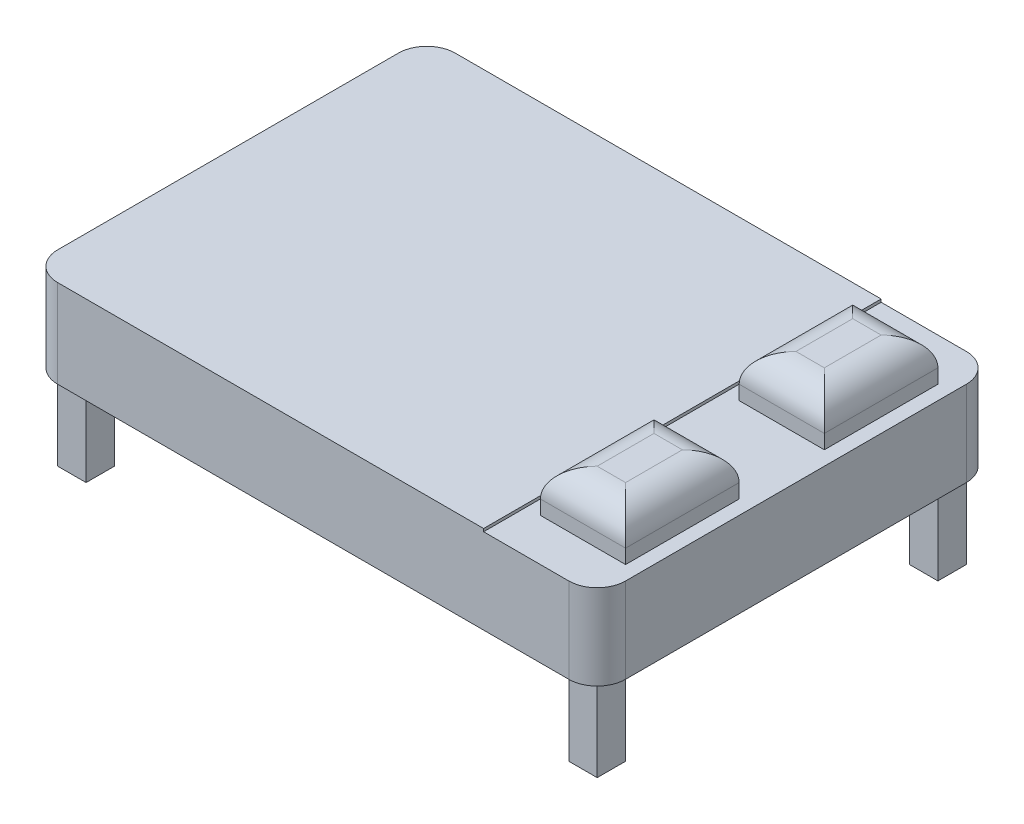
ISO-10303-21;
HEADER;
FILE_DESCRIPTION(('STEP AP214'),'2;1');
FILE_NAME('part.step','',(''),(''),'','','');
FILE_SCHEMA(('AUTOMOTIVE_DESIGN { 1 0 10303 214 1 1 1 1 }'));
ENDSEC;
DATA;
#1=APPLICATION_CONTEXT('core data for automotive mechanical design processes');
#2=APPLICATION_PROTOCOL_DEFINITION('international standard','automotive_design',2000,#1);
#3=PRODUCT_CONTEXT('',#1,'mechanical');
#4=PRODUCT('Part','Part','',(#3));
#5=PRODUCT_RELATED_PRODUCT_CATEGORY('part','',(#4));
#6=PRODUCT_DEFINITION_FORMATION('','',#4);
#7=PRODUCT_DEFINITION_CONTEXT('part definition',#1,'design');
#8=PRODUCT_DEFINITION('design','',#6,#7);
#9=PRODUCT_DEFINITION_SHAPE('','',#8);
#10=(LENGTH_UNIT() NAMED_UNIT(*) SI_UNIT(.MILLI.,.METRE.));
#11=(NAMED_UNIT(*) PLANE_ANGLE_UNIT() SI_UNIT($,.RADIAN.));
#12=(NAMED_UNIT(*) SI_UNIT($,.STERADIAN.) SOLID_ANGLE_UNIT());
#13=UNCERTAINTY_MEASURE_WITH_UNIT(LENGTH_MEASURE(1.E-05),#10,'distance_accuracy_value','');
#14=(GEOMETRIC_REPRESENTATION_CONTEXT(3) GLOBAL_UNCERTAINTY_ASSIGNED_CONTEXT((#13)) GLOBAL_UNIT_ASSIGNED_CONTEXT((#10,
#11,#12)) REPRESENTATION_CONTEXT('',''));
#15=CARTESIAN_POINT('',(0.,0.,0.));
#16=DIRECTION('',(0.,0.,1.));
#17=DIRECTION('',(1.,0.,0.));
#18=AXIS2_PLACEMENT_3D('',#15,#16,#17);
#19=CARTESIAN_POINT('',(0.,300.,0.));
#20=DIRECTION('',(0.,1.,0.));
#21=DIRECTION('',(0.,0.,1.));
#22=AXIS2_PLACEMENT_3D('',#19,#20,#21);
#23=PLANE('',#22);
#24=DIRECTION('',(0.,0.,-1.));
#25=VECTOR('',#24,1.);
#26=CARTESIAN_POINT('',(1000.,300.,700.));
#27=LINE('',#26,#25);
#28=CARTESIAN_POINT('',(1000.,300.,600.));
#29=VERTEX_POINT('',#28);
#30=CARTESIAN_POINT('',(1000.,300.,-600.));
#31=VERTEX_POINT('',#30);
#32=EDGE_CURVE('E424',#29,#31,#27,.T.);
#33=ORIENTED_EDGE('',*,*,#32,.T.);
#34=CARTESIAN_POINT('',(900.,300.,-600.));
#35=DIRECTION('',(0.,1.,0.));
#36=DIRECTION('',(0.,0.,1.));
#37=AXIS2_PLACEMENT_3D('',#34,#35,#36);
#38=CIRCLE('',#37,100.);
#39=CARTESIAN_POINT('',(900.,300.,-700.));
#40=VERTEX_POINT('',#39);
#41=EDGE_CURVE('E451',#31,#40,#38,.T.);
#42=ORIENTED_EDGE('',*,*,#41,.T.);
#43=DIRECTION('',(-1.,0.,0.));
#44=VECTOR('',#43,1.);
#45=CARTESIAN_POINT('',(1000.,300.,-700.));
#46=LINE('',#45,#44);
#47=CARTESIAN_POINT('',(600.,300.,-700.));
#48=VERTEX_POINT('',#47);
#49=EDGE_CURVE('E369',#40,#48,#46,.T.);
#50=ORIENTED_EDGE('',*,*,#49,.T.);
#51=DIRECTION('',(0.,0.,-1.));
#52=VECTOR('',#51,1.);
#53=CARTESIAN_POINT('',(600.,300.,-700.));
#54=LINE('',#53,#52);
#55=CARTESIAN_POINT('',(600.,300.,700.));
#56=VERTEX_POINT('',#55);
#57=EDGE_CURVE('E334',#56,#48,#54,.T.);
#58=ORIENTED_EDGE('',*,*,#57,.F.);
#59=DIRECTION('',(1.,0.,0.));
#60=VECTOR('',#59,1.);
#61=CARTESIAN_POINT('',(1000.,300.,700.));
#62=LINE('',#61,#60);
#63=CARTESIAN_POINT('',(900.,300.,700.));
#64=VERTEX_POINT('',#63);
#65=EDGE_CURVE('E353',#56,#64,#62,.T.);
#66=ORIENTED_EDGE('',*,*,#65,.T.);
#67=CARTESIAN_POINT('',(900.,300.,600.));
#68=DIRECTION('',(0.,1.,0.));
#69=DIRECTION('',(0.,0.,1.));
#70=AXIS2_PLACEMENT_3D('',#67,#68,#69);
#71=CIRCLE('',#70,100.);
#72=EDGE_CURVE('E453',#64,#29,#71,.T.);
#73=ORIENTED_EDGE('',*,*,#72,.T.);
#74=EDGE_LOOP('',(#33,#42,#50,#58,#66,#73));
#75=FACE_BOUND('',#74,.T.);
#76=DIRECTION('',(1.,0.,0.));
#77=VECTOR('',#76,1.);
#78=CARTESIAN_POINT('',(650.,300.,-150.));
#79=LINE('',#78,#77);
#80=CARTESIAN_POINT('',(650.,300.,-150.));
#81=VERTEX_POINT('',#80);
#82=CARTESIAN_POINT('',(950.,300.,-150.));
#83=VERTEX_POINT('',#82);
#84=EDGE_CURVE('E317',#81,#83,#79,.T.);
#85=ORIENTED_EDGE('',*,*,#84,.F.);
#86=DIRECTION('',(0.,0.,1.));
#87=VECTOR('',#86,1.);
#88=CARTESIAN_POINT('',(650.,300.,-550.));
#89=LINE('',#88,#87);
#90=CARTESIAN_POINT('',(650.,300.,-550.));
#91=VERTEX_POINT('',#90);
#92=EDGE_CURVE('E291',#91,#81,#89,.T.);
#93=ORIENTED_EDGE('',*,*,#92,.F.);
#94=DIRECTION('',(-1.,0.,0.));
#95=VECTOR('',#94,1.);
#96=CARTESIAN_POINT('',(650.,300.,-550.));
#97=LINE('',#96,#95);
#98=CARTESIAN_POINT('',(950.,300.,-550.));
#99=VERTEX_POINT('',#98);
#100=EDGE_CURVE('E323',#99,#91,#97,.T.);
#101=ORIENTED_EDGE('',*,*,#100,.F.);
#102=DIRECTION('',(0.,0.,-1.));
#103=VECTOR('',#102,1.);
#104=CARTESIAN_POINT('',(950.,300.,-550.));
#105=LINE('',#104,#103);
#106=EDGE_CURVE('E320',#83,#99,#105,.T.);
#107=ORIENTED_EDGE('',*,*,#106,.F.);
#108=EDGE_LOOP('',(#85,#93,#101,#107));
#109=FACE_BOUND('',#108,.T.);
#110=DIRECTION('',(1.,0.,0.));
#111=VECTOR('',#110,1.);
#112=CARTESIAN_POINT('',(650.,300.,550.));
#113=LINE('',#112,#111);
#114=CARTESIAN_POINT('',(650.,300.,550.));
#115=VERTEX_POINT('',#114);
#116=CARTESIAN_POINT('',(950.,300.,550.));
#117=VERTEX_POINT('',#116);
#118=EDGE_CURVE('E285',#115,#117,#113,.T.);
#119=ORIENTED_EDGE('',*,*,#118,.F.);
#120=DIRECTION('',(0.,0.,1.));
#121=VECTOR('',#120,1.);
#122=CARTESIAN_POINT('',(650.,300.,150.));
#123=LINE('',#122,#121);
#124=CARTESIAN_POINT('',(650.,300.,150.));
#125=VERTEX_POINT('',#124);
#126=EDGE_CURVE('E295',#125,#115,#123,.T.);
#127=ORIENTED_EDGE('',*,*,#126,.F.);
#128=DIRECTION('',(-1.,0.,0.));
#129=VECTOR('',#128,1.);
#130=CARTESIAN_POINT('',(650.,300.,150.));
#131=LINE('',#130,#129);
#132=CARTESIAN_POINT('',(950.,300.,150.));
#133=VERTEX_POINT('',#132);
#134=EDGE_CURVE('E307',#133,#125,#131,.T.);
#135=ORIENTED_EDGE('',*,*,#134,.F.);
#136=DIRECTION('',(0.,0.,-1.));
#137=VECTOR('',#136,1.);
#138=CARTESIAN_POINT('',(950.,300.,150.));
#139=LINE('',#138,#137);
#140=EDGE_CURVE('E305',#117,#133,#139,.T.);
#141=ORIENTED_EDGE('',*,*,#140,.F.);
#142=EDGE_LOOP('',(#119,#127,#135,#141));
#143=FACE_BOUND('',#142,.T.);
#144=ADVANCED_FACE('F34',(#75,#109,#143),#23,.T.);
#145=CARTESIAN_POINT('',(0.,0.,0.));
#146=DIRECTION('',(0.,1.,0.));
#147=DIRECTION('',(0.,0.,1.));
#148=AXIS2_PLACEMENT_3D('',#145,#146,#147);
#149=PLANE('',#148);
#150=DIRECTION('',(0.,0.,1.));
#151=VECTOR('',#150,1.);
#152=CARTESIAN_POINT('',(-850.,0.,650.));
#153=LINE('',#152,#151);
#154=CARTESIAN_POINT('',(-850.,0.,550.));
#155=VERTEX_POINT('',#154);
#156=CARTESIAN_POINT('',(-850.,0.,650.));
#157=VERTEX_POINT('',#156);
#158=EDGE_CURVE('E1111',#155,#157,#153,.T.);
#159=ORIENTED_EDGE('',*,*,#158,.F.);
#160=DIRECTION('',(1.,0.,0.));
#161=VECTOR('',#160,1.);
#162=CARTESIAN_POINT('',(-950.,0.,550.));
#163=LINE('',#162,#161);
#164=CARTESIAN_POINT('',(-950.,0.,550.));
#165=VERTEX_POINT('',#164);
#166=EDGE_CURVE('E1116',#165,#155,#163,.T.);
#167=ORIENTED_EDGE('',*,*,#166,.F.);
#168=DIRECTION('',(0.,0.,-1.));
#169=VECTOR('',#168,1.);
#170=CARTESIAN_POINT('',(-950.,0.,650.));
#171=LINE('',#170,#169);
#172=CARTESIAN_POINT('',(-950.,0.,650.));
#173=VERTEX_POINT('',#172);
#174=EDGE_CURVE('E1128',#173,#165,#171,.T.);
#175=ORIENTED_EDGE('',*,*,#174,.F.);
#176=DIRECTION('',(-1.,0.,0.));
#177=VECTOR('',#176,1.);
#178=CARTESIAN_POINT('',(-950.,0.,650.));
#179=LINE('',#178,#177);
#180=EDGE_CURVE('E1125',#157,#173,#179,.T.);
#181=ORIENTED_EDGE('',*,*,#180,.F.);
#182=EDGE_LOOP('',(#159,#167,#175,#181));
#183=FACE_BOUND('',#182,.T.);
#184=DIRECTION('',(-1.,0.,0.));
#185=VECTOR('',#184,1.);
#186=CARTESIAN_POINT('',(1000.,0.,-700.));
#187=LINE('',#186,#185);
#188=CARTESIAN_POINT('',(900.,0.,-700.));
#189=VERTEX_POINT('',#188);
#190=CARTESIAN_POINT('',(-900.,0.,-700.));
#191=VERTEX_POINT('',#190);
#192=EDGE_CURVE('E437',#189,#191,#187,.T.);
#193=ORIENTED_EDGE('',*,*,#192,.F.);
#194=CARTESIAN_POINT('',(900.,0.,-600.));
#195=DIRECTION('',(0.,1.,0.));
#196=DIRECTION('',(0.,0.,1.));
#197=AXIS2_PLACEMENT_3D('',#194,#195,#196);
#198=CIRCLE('',#197,100.);
#199=CARTESIAN_POINT('',(1000.,0.,-600.));
#200=VERTEX_POINT('',#199);
#201=EDGE_CURVE('E491',#189,#200,#198,.F.);
#202=ORIENTED_EDGE('',*,*,#201,.T.);
#203=DIRECTION('',(0.,0.,-1.));
#204=VECTOR('',#203,1.);
#205=CARTESIAN_POINT('',(1000.,0.,700.));
#206=LINE('',#205,#204);
#207=CARTESIAN_POINT('',(1000.,0.,600.));
#208=VERTEX_POINT('',#207);
#209=EDGE_CURVE('E435',#208,#200,#206,.T.);
#210=ORIENTED_EDGE('',*,*,#209,.F.);
#211=CARTESIAN_POINT('',(900.,0.,600.));
#212=DIRECTION('',(0.,1.,0.));
#213=DIRECTION('',(0.,0.,1.));
#214=AXIS2_PLACEMENT_3D('',#211,#212,#213);
#215=CIRCLE('',#214,100.);
#216=CARTESIAN_POINT('',(900.,0.,700.));
#217=VERTEX_POINT('',#216);
#218=EDGE_CURVE('E487',#208,#217,#215,.F.);
#219=ORIENTED_EDGE('',*,*,#218,.T.);
#220=DIRECTION('',(1.,0.,0.));
#221=VECTOR('',#220,1.);
#222=CARTESIAN_POINT('',(1000.,0.,700.));
#223=LINE('',#222,#221);
#224=CARTESIAN_POINT('',(-900.,0.,700.));
#225=VERTEX_POINT('',#224);
#226=EDGE_CURVE('E431',#225,#217,#223,.T.);
#227=ORIENTED_EDGE('',*,*,#226,.F.);
#228=CARTESIAN_POINT('',(-900.,0.,600.));
#229=DIRECTION('',(0.,1.,0.));
#230=DIRECTION('',(0.,0.,1.));
#231=AXIS2_PLACEMENT_3D('',#228,#229,#230);
#232=CIRCLE('',#231,100.);
#233=CARTESIAN_POINT('',(-1000.,0.,600.));
#234=VERTEX_POINT('',#233);
#235=EDGE_CURVE('E485',#225,#234,#232,.F.);
#236=ORIENTED_EDGE('',*,*,#235,.T.);
#237=DIRECTION('',(0.,0.,1.));
#238=VECTOR('',#237,1.);
#239=CARTESIAN_POINT('',(-1000.,0.,700.));
#240=LINE('',#239,#238);
#241=CARTESIAN_POINT('',(-1000.,0.,-600.));
#242=VERTEX_POINT('',#241);
#243=EDGE_CURVE('E429',#242,#234,#240,.T.);
#244=ORIENTED_EDGE('',*,*,#243,.F.);
#245=CARTESIAN_POINT('',(-900.,0.,-600.));
#246=DIRECTION('',(0.,1.,0.));
#247=DIRECTION('',(0.,0.,1.));
#248=AXIS2_PLACEMENT_3D('',#245,#246,#247);
#249=CIRCLE('',#248,100.);
#250=EDGE_CURVE('E489',#242,#191,#249,.F.);
#251=ORIENTED_EDGE('',*,*,#250,.T.);
#252=EDGE_LOOP('',(#193,#202,#210,#219,#227,#236,#244,#251));
#253=FACE_BOUND('',#252,.T.);
#254=DIRECTION('',(1.,0.,0.));
#255=VECTOR('',#254,1.);
#256=CARTESIAN_POINT('',(-950.,0.,-550.));
#257=LINE('',#256,#255);
#258=CARTESIAN_POINT('',(-950.,0.,-550.));
#259=VERTEX_POINT('',#258);
#260=CARTESIAN_POINT('',(-850.,0.,-550.));
#261=VERTEX_POINT('',#260);
#262=EDGE_CURVE('E1095',#259,#261,#257,.T.);
#263=ORIENTED_EDGE('',*,*,#262,.T.);
#264=DIRECTION('',(0.,0.,-1.));
#265=VECTOR('',#264,1.);
#266=CARTESIAN_POINT('',(-850.,0.,-650.));
#267=LINE('',#266,#265);
#268=CARTESIAN_POINT('',(-850.,0.,-650.));
#269=VERTEX_POINT('',#268);
#270=EDGE_CURVE('E1078',#261,#269,#267,.T.);
#271=ORIENTED_EDGE('',*,*,#270,.T.);
#272=DIRECTION('',(-1.,0.,0.));
#273=VECTOR('',#272,1.);
#274=CARTESIAN_POINT('',(-950.,0.,-650.));
#275=LINE('',#274,#273);
#276=CARTESIAN_POINT('',(-950.,0.,-650.));
#277=VERTEX_POINT('',#276);
#278=EDGE_CURVE('E1083',#269,#277,#275,.T.);
#279=ORIENTED_EDGE('',*,*,#278,.T.);
#280=DIRECTION('',(0.,0.,1.));
#281=VECTOR('',#280,1.);
#282=CARTESIAN_POINT('',(-950.,0.,-650.));
#283=LINE('',#282,#281);
#284=EDGE_CURVE('E1098',#277,#259,#283,.T.);
#285=ORIENTED_EDGE('',*,*,#284,.T.);
#286=EDGE_LOOP('',(#263,#271,#279,#285));
#287=FACE_BOUND('',#286,.T.);
#288=DIRECTION('',(-1.,0.,0.));
#289=VECTOR('',#288,1.);
#290=CARTESIAN_POINT('',(950.,0.,550.));
#291=LINE('',#290,#289);
#292=CARTESIAN_POINT('',(950.,0.,550.));
#293=VERTEX_POINT('',#292);
#294=CARTESIAN_POINT('',(850.,0.,550.));
#295=VERTEX_POINT('',#294);
#296=EDGE_CURVE('E1042',#293,#295,#291,.T.);
#297=ORIENTED_EDGE('',*,*,#296,.T.);
#298=DIRECTION('',(0.,0.,1.));
#299=VECTOR('',#298,1.);
#300=CARTESIAN_POINT('',(850.,0.,650.));
#301=LINE('',#300,#299);
#302=CARTESIAN_POINT('',(850.,0.,650.));
#303=VERTEX_POINT('',#302);
#304=EDGE_CURVE('E1038',#295,#303,#301,.T.);
#305=ORIENTED_EDGE('',*,*,#304,.T.);
#306=DIRECTION('',(1.,0.,0.));
#307=VECTOR('',#306,1.);
#308=CARTESIAN_POINT('',(950.,0.,650.));
#309=LINE('',#308,#307);
#310=CARTESIAN_POINT('',(950.,0.,650.));
#311=VERTEX_POINT('',#310);
#312=EDGE_CURVE('E1053',#303,#311,#309,.T.);
#313=ORIENTED_EDGE('',*,*,#312,.T.);
#314=DIRECTION('',(0.,0.,-1.));
#315=VECTOR('',#314,1.);
#316=CARTESIAN_POINT('',(950.,0.,650.));
#317=LINE('',#316,#315);
#318=EDGE_CURVE('E1065',#311,#293,#317,.T.);
#319=ORIENTED_EDGE('',*,*,#318,.T.);
#320=EDGE_LOOP('',(#297,#305,#313,#319));
#321=FACE_BOUND('',#320,.T.);
#322=DIRECTION('',(0.,0.,-1.));
#323=VECTOR('',#322,1.);
#324=CARTESIAN_POINT('',(850.,0.,-650.));
#325=LINE('',#324,#323);
#326=CARTESIAN_POINT('',(850.,0.,-550.));
#327=VERTEX_POINT('',#326);
#328=CARTESIAN_POINT('',(850.,0.,-650.));
#329=VERTEX_POINT('',#328);
#330=EDGE_CURVE('E363',#327,#329,#325,.T.);
#331=ORIENTED_EDGE('',*,*,#330,.F.);
#332=DIRECTION('',(-1.,0.,0.));
#333=VECTOR('',#332,1.);
#334=CARTESIAN_POINT('',(950.,0.,-550.));
#335=LINE('',#334,#333);
#336=CARTESIAN_POINT('',(950.,0.,-550.));
#337=VERTEX_POINT('',#336);
#338=EDGE_CURVE('E1033',#337,#327,#335,.T.);
#339=ORIENTED_EDGE('',*,*,#338,.F.);
#340=DIRECTION('',(0.,0.,1.));
#341=VECTOR('',#340,1.);
#342=CARTESIAN_POINT('',(950.,0.,-650.));
#343=LINE('',#342,#341);
#344=CARTESIAN_POINT('',(950.,0.,-650.));
#345=VERTEX_POINT('',#344);
#346=EDGE_CURVE('E1167',#345,#337,#343,.T.);
#347=ORIENTED_EDGE('',*,*,#346,.F.);
#348=DIRECTION('',(1.,0.,0.));
#349=VECTOR('',#348,1.);
#350=CARTESIAN_POINT('',(950.,0.,-650.));
#351=LINE('',#350,#349);
#352=EDGE_CURVE('E1162',#329,#345,#351,.T.);
#353=ORIENTED_EDGE('',*,*,#352,.F.);
#354=EDGE_LOOP('',(#331,#339,#347,#353));
#355=FACE_BOUND('',#354,.T.);
#356=ADVANCED_FACE('F482',(#183,#253,#287,#321,#355),#149,.F.);
#357=CARTESIAN_POINT('',(-1000.,300.,700.));
#358=DIRECTION('',(1.,0.,0.));
#359=DIRECTION('',(0.,0.,-1.));
#360=AXIS2_PLACEMENT_3D('',#357,#358,#359);
#361=PLANE('',#360);
#362=DIRECTION('',(0.,0.,1.));
#363=VECTOR('',#362,1.);
#364=CARTESIAN_POINT('',(-1000.,310.,-700.));
#365=LINE('',#364,#363);
#366=CARTESIAN_POINT('',(-1000.,310.,-600.));
#367=VERTEX_POINT('',#366);
#368=CARTESIAN_POINT('',(-1000.,310.,600.));
#369=VERTEX_POINT('',#368);
#370=EDGE_CURVE('E335',#367,#369,#365,.T.);
#371=ORIENTED_EDGE('',*,*,#370,.F.);
#372=DIRECTION('',(0.,-1.,0.));
#373=VECTOR('',#372,1.);
#374=CARTESIAN_POINT('',(-1000.,300.,-600.));
#375=LINE('',#374,#373);
#376=EDGE_CURVE('E464',#367,#242,#375,.T.);
#377=ORIENTED_EDGE('',*,*,#376,.T.);
#378=ORIENTED_EDGE('',*,*,#243,.T.);
#379=DIRECTION('',(0.,-1.,0.));
#380=VECTOR('',#379,1.);
#381=CARTESIAN_POINT('',(-1000.,300.,600.));
#382=LINE('',#381,#380);
#383=EDGE_CURVE('E57',#234,#369,#382,.F.);
#384=ORIENTED_EDGE('',*,*,#383,.T.);
#385=EDGE_LOOP('',(#371,#377,#378,#384));
#386=FACE_BOUND('',#385,.T.);
#387=ADVANCED_FACE('F509',(#386),#361,.F.);
#388=CARTESIAN_POINT('',(1000.,300.,700.));
#389=DIRECTION('',(0.,0.,-1.));
#390=DIRECTION('',(-1.,0.,0.));
#391=AXIS2_PLACEMENT_3D('',#388,#389,#390);
#392=PLANE('',#391);
#393=ORIENTED_EDGE('',*,*,#226,.T.);
#394=DIRECTION('',(0.,-1.,0.));
#395=VECTOR('',#394,1.);
#396=CARTESIAN_POINT('',(900.,300.,700.));
#397=LINE('',#396,#395);
#398=EDGE_CURVE('E11',#217,#64,#397,.F.);
#399=ORIENTED_EDGE('',*,*,#398,.T.);
#400=ORIENTED_EDGE('',*,*,#65,.F.);
#401=DIRECTION('',(0.,-1.,0.));
#402=VECTOR('',#401,1.);
#403=CARTESIAN_POINT('',(600.,310.,700.));
#404=LINE('',#403,#402);
#405=CARTESIAN_POINT('',(600.,310.,700.));
#406=VERTEX_POINT('',#405);
#407=EDGE_CURVE('E358',#406,#56,#404,.T.);
#408=ORIENTED_EDGE('',*,*,#407,.F.);
#409=DIRECTION('',(1.,0.,0.));
#410=VECTOR('',#409,1.);
#411=CARTESIAN_POINT('',(-1000.,310.,700.));
#412=LINE('',#411,#410);
#413=CARTESIAN_POINT('',(-900.,310.,700.));
#414=VERTEX_POINT('',#413);
#415=EDGE_CURVE('E337',#414,#406,#412,.T.);
#416=ORIENTED_EDGE('',*,*,#415,.F.);
#417=DIRECTION('',(0.,-1.,0.));
#418=VECTOR('',#417,1.);
#419=CARTESIAN_POINT('',(-900.,300.,700.));
#420=LINE('',#419,#418);
#421=EDGE_CURVE('E42',#414,#225,#420,.T.);
#422=ORIENTED_EDGE('',*,*,#421,.T.);
#423=EDGE_LOOP('',(#393,#399,#400,#408,#416,#422));
#424=FACE_BOUND('',#423,.T.);
#425=ADVANCED_FACE('F477',(#424),#392,.F.);
#426=CARTESIAN_POINT('',(1000.,300.,700.));
#427=DIRECTION('',(-1.,0.,0.));
#428=DIRECTION('',(0.,0.,1.));
#429=AXIS2_PLACEMENT_3D('',#426,#427,#428);
#430=PLANE('',#429);
#431=ORIENTED_EDGE('',*,*,#209,.T.);
#432=DIRECTION('',(0.,-1.,0.));
#433=VECTOR('',#432,1.);
#434=CARTESIAN_POINT('',(1000.,300.,-600.));
#435=LINE('',#434,#433);
#436=EDGE_CURVE('E461',#200,#31,#435,.F.);
#437=ORIENTED_EDGE('',*,*,#436,.T.);
#438=ORIENTED_EDGE('',*,*,#32,.F.);
#439=DIRECTION('',(0.,-1.,0.));
#440=VECTOR('',#439,1.);
#441=CARTESIAN_POINT('',(1000.,300.,600.));
#442=LINE('',#441,#440);
#443=EDGE_CURVE('E496',#29,#208,#442,.T.);
#444=ORIENTED_EDGE('',*,*,#443,.T.);
#445=EDGE_LOOP('',(#431,#437,#438,#444));
#446=FACE_BOUND('',#445,.T.);
#447=ADVANCED_FACE('F497',(#446),#430,.F.);
#448=CARTESIAN_POINT('',(1000.,300.,-700.));
#449=DIRECTION('',(0.,0.,1.));
#450=DIRECTION('',(1.,0.,0.));
#451=AXIS2_PLACEMENT_3D('',#448,#449,#450);
#452=PLANE('',#451);
#453=ORIENTED_EDGE('',*,*,#49,.F.);
#454=DIRECTION('',(0.,-1.,0.));
#455=VECTOR('',#454,1.);
#456=CARTESIAN_POINT('',(900.,300.,-700.));
#457=LINE('',#456,#455);
#458=EDGE_CURVE('E462',#40,#189,#457,.T.);
#459=ORIENTED_EDGE('',*,*,#458,.T.);
#460=ORIENTED_EDGE('',*,*,#192,.T.);
#461=DIRECTION('',(0.,-1.,0.));
#462=VECTOR('',#461,1.);
#463=CARTESIAN_POINT('',(-900.,300.,-700.));
#464=LINE('',#463,#462);
#465=CARTESIAN_POINT('',(-900.,310.,-700.));
#466=VERTEX_POINT('',#465);
#467=EDGE_CURVE('E402',#191,#466,#464,.F.);
#468=ORIENTED_EDGE('',*,*,#467,.T.);
#469=DIRECTION('',(-1.,0.,0.));
#470=VECTOR('',#469,1.);
#471=CARTESIAN_POINT('',(-1000.,310.,-700.));
#472=LINE('',#471,#470);
#473=CARTESIAN_POINT('',(600.,310.,-700.));
#474=VERTEX_POINT('',#473);
#475=EDGE_CURVE('E341',#474,#466,#472,.T.);
#476=ORIENTED_EDGE('',*,*,#475,.F.);
#477=DIRECTION('',(0.,-1.,0.));
#478=VECTOR('',#477,1.);
#479=CARTESIAN_POINT('',(600.,310.,-700.));
#480=LINE('',#479,#478);
#481=EDGE_CURVE('E344',#474,#48,#480,.T.);
#482=ORIENTED_EDGE('',*,*,#481,.T.);
#483=EDGE_LOOP('',(#453,#459,#460,#468,#476,#482));
#484=FACE_BOUND('',#483,.T.);
#485=ADVANCED_FACE('F510',(#484),#452,.F.);
#486=CARTESIAN_POINT('',(-850.,-300.,650.));
#487=DIRECTION('',(-1.,0.,0.));
#488=DIRECTION('',(0.,0.,1.));
#489=AXIS2_PLACEMENT_3D('',#486,#487,#488);
#490=PLANE('',#489);
#491=ORIENTED_EDGE('',*,*,#158,.T.);
#492=DIRECTION('',(0.,1.,0.));
#493=VECTOR('',#492,1.);
#494=CARTESIAN_POINT('',(-850.,-300.,650.));
#495=LINE('',#494,#493);
#496=CARTESIAN_POINT('',(-850.,-300.,650.));
#497=VERTEX_POINT('',#496);
#498=EDGE_CURVE('E432',#497,#157,#495,.T.);
#499=ORIENTED_EDGE('',*,*,#498,.F.);
#500=DIRECTION('',(0.,0.,1.));
#501=VECTOR('',#500,1.);
#502=CARTESIAN_POINT('',(-850.,-300.,650.));
#503=LINE('',#502,#501);
#504=CARTESIAN_POINT('',(-850.,-300.,550.));
#505=VERTEX_POINT('',#504);
#506=EDGE_CURVE('E1112',#505,#497,#503,.T.);
#507=ORIENTED_EDGE('',*,*,#506,.F.);
#508=DIRECTION('',(0.,1.,0.));
#509=VECTOR('',#508,1.);
#510=CARTESIAN_POINT('',(-850.,-300.,550.));
#511=LINE('',#510,#509);
#512=EDGE_CURVE('E1122',#505,#155,#511,.T.);
#513=ORIENTED_EDGE('',*,*,#512,.T.);
#514=EDGE_LOOP('',(#491,#499,#507,#513));
#515=FACE_BOUND('',#514,.T.);
#516=ADVANCED_FACE('F512',(#515),#490,.F.);
#517=CARTESIAN_POINT('',(-950.,-300.,650.));
#518=DIRECTION('',(0.,0.,-1.));
#519=DIRECTION('',(-1.,0.,0.));
#520=AXIS2_PLACEMENT_3D('',#517,#518,#519);
#521=PLANE('',#520);
#522=ORIENTED_EDGE('',*,*,#180,.T.);
#523=DIRECTION('',(0.,1.,0.));
#524=VECTOR('',#523,1.);
#525=CARTESIAN_POINT('',(-950.,-300.,650.));
#526=LINE('',#525,#524);
#527=CARTESIAN_POINT('',(-950.,-300.,650.));
#528=VERTEX_POINT('',#527);
#529=EDGE_CURVE('E1138',#528,#173,#526,.T.);
#530=ORIENTED_EDGE('',*,*,#529,.F.);
#531=DIRECTION('',(-1.,0.,0.));
#532=VECTOR('',#531,1.);
#533=CARTESIAN_POINT('',(-950.,-300.,650.));
#534=LINE('',#533,#532);
#535=EDGE_CURVE('E1115',#497,#528,#534,.T.);
#536=ORIENTED_EDGE('',*,*,#535,.F.);
#537=ORIENTED_EDGE('',*,*,#498,.T.);
#538=EDGE_LOOP('',(#522,#530,#536,#537));
#539=FACE_BOUND('',#538,.T.);
#540=ADVANCED_FACE('F518',(#539),#521,.F.);
#541=CARTESIAN_POINT('',(-950.,-300.,650.));
#542=DIRECTION('',(1.,0.,0.));
#543=DIRECTION('',(0.,0.,-1.));
#544=AXIS2_PLACEMENT_3D('',#541,#542,#543);
#545=PLANE('',#544);
#546=ORIENTED_EDGE('',*,*,#174,.T.);
#547=DIRECTION('',(0.,1.,0.));
#548=VECTOR('',#547,1.);
#549=CARTESIAN_POINT('',(-950.,-300.,550.));
#550=LINE('',#549,#548);
#551=CARTESIAN_POINT('',(-950.,-300.,550.));
#552=VERTEX_POINT('',#551);
#553=EDGE_CURVE('E1135',#552,#165,#550,.T.);
#554=ORIENTED_EDGE('',*,*,#553,.F.);
#555=DIRECTION('',(0.,0.,-1.));
#556=VECTOR('',#555,1.);
#557=CARTESIAN_POINT('',(-950.,-300.,650.));
#558=LINE('',#557,#556);
#559=EDGE_CURVE('E1118',#528,#552,#558,.T.);
#560=ORIENTED_EDGE('',*,*,#559,.F.);
#561=ORIENTED_EDGE('',*,*,#529,.T.);
#562=EDGE_LOOP('',(#546,#554,#560,#561));
#563=FACE_BOUND('',#562,.T.);
#564=ADVANCED_FACE('F532',(#563),#545,.F.);
#565=CARTESIAN_POINT('',(-950.,-300.,550.));
#566=DIRECTION('',(0.,0.,1.));
#567=DIRECTION('',(1.,0.,0.));
#568=AXIS2_PLACEMENT_3D('',#565,#566,#567);
#569=PLANE('',#568);
#570=ORIENTED_EDGE('',*,*,#166,.T.);
#571=ORIENTED_EDGE('',*,*,#512,.F.);
#572=DIRECTION('',(1.,0.,0.));
#573=VECTOR('',#572,1.);
#574=CARTESIAN_POINT('',(-950.,-300.,550.));
#575=LINE('',#574,#573);
#576=EDGE_CURVE('E1120',#552,#505,#575,.T.);
#577=ORIENTED_EDGE('',*,*,#576,.F.);
#578=ORIENTED_EDGE('',*,*,#553,.T.);
#579=EDGE_LOOP('',(#570,#571,#577,#578));
#580=FACE_BOUND('',#579,.T.);
#581=ADVANCED_FACE('F536',(#580),#569,.F.);
#582=CARTESIAN_POINT('',(0.,-300.,0.));
#583=DIRECTION('',(0.,-1.,0.));
#584=DIRECTION('',(0.,0.,-1.));
#585=AXIS2_PLACEMENT_3D('',#582,#583,#584);
#586=PLANE('',#585);
#587=ORIENTED_EDGE('',*,*,#506,.T.);
#588=ORIENTED_EDGE('',*,*,#535,.T.);
#589=ORIENTED_EDGE('',*,*,#559,.T.);
#590=ORIENTED_EDGE('',*,*,#576,.T.);
#591=EDGE_LOOP('',(#587,#588,#589,#590));
#592=FACE_BOUND('',#591,.T.);
#593=ADVANCED_FACE('F540',(#592),#586,.T.);
#594=CARTESIAN_POINT('',(-850.,-300.,-650.));
#595=DIRECTION('',(1.,0.,0.));
#596=DIRECTION('',(0.,0.,-1.));
#597=AXIS2_PLACEMENT_3D('',#594,#595,#596);
#598=PLANE('',#597);
#599=ORIENTED_EDGE('',*,*,#270,.F.);
#600=DIRECTION('',(0.,1.,0.));
#601=VECTOR('',#600,1.);
#602=CARTESIAN_POINT('',(-850.,-300.,-550.));
#603=LINE('',#602,#601);
#604=CARTESIAN_POINT('',(-850.,-300.,-550.));
#605=VERTEX_POINT('',#604);
#606=EDGE_CURVE('E1109',#605,#261,#603,.T.);
#607=ORIENTED_EDGE('',*,*,#606,.F.);
#608=DIRECTION('',(0.,0.,-1.));
#609=VECTOR('',#608,1.);
#610=CARTESIAN_POINT('',(-850.,-300.,-650.));
#611=LINE('',#610,#609);
#612=CARTESIAN_POINT('',(-850.,-300.,-650.));
#613=VERTEX_POINT('',#612);
#614=EDGE_CURVE('E1079',#605,#613,#611,.T.);
#615=ORIENTED_EDGE('',*,*,#614,.T.);
#616=DIRECTION('',(0.,1.,0.));
#617=VECTOR('',#616,1.);
#618=CARTESIAN_POINT('',(-850.,-300.,-650.));
#619=LINE('',#618,#617);
#620=EDGE_CURVE('E1092',#613,#269,#619,.T.);
#621=ORIENTED_EDGE('',*,*,#620,.T.);
#622=EDGE_LOOP('',(#599,#607,#615,#621));
#623=FACE_BOUND('',#622,.T.);
#624=ADVANCED_FACE('F544',(#623),#598,.T.);
#625=CARTESIAN_POINT('',(-950.,-300.,-550.));
#626=DIRECTION('',(0.,0.,1.));
#627=DIRECTION('',(1.,0.,0.));
#628=AXIS2_PLACEMENT_3D('',#625,#626,#627);
#629=PLANE('',#628);
#630=ORIENTED_EDGE('',*,*,#262,.F.);
#631=DIRECTION('',(0.,1.,0.));
#632=VECTOR('',#631,1.);
#633=CARTESIAN_POINT('',(-950.,-300.,-550.));
#634=LINE('',#633,#632);
#635=CARTESIAN_POINT('',(-950.,-300.,-550.));
#636=VERTEX_POINT('',#635);
#637=EDGE_CURVE('E1107',#636,#259,#634,.T.);
#638=ORIENTED_EDGE('',*,*,#637,.F.);
#639=DIRECTION('',(1.,0.,0.));
#640=VECTOR('',#639,1.);
#641=CARTESIAN_POINT('',(-950.,-300.,-550.));
#642=LINE('',#641,#640);
#643=EDGE_CURVE('E1082',#636,#605,#642,.T.);
#644=ORIENTED_EDGE('',*,*,#643,.T.);
#645=ORIENTED_EDGE('',*,*,#606,.T.);
#646=EDGE_LOOP('',(#630,#638,#644,#645));
#647=FACE_BOUND('',#646,.T.);
#648=ADVANCED_FACE('F548',(#647),#629,.T.);
#649=CARTESIAN_POINT('',(-950.,-300.,-650.));
#650=DIRECTION('',(-1.,0.,0.));
#651=DIRECTION('',(0.,0.,1.));
#652=AXIS2_PLACEMENT_3D('',#649,#650,#651);
#653=PLANE('',#652);
#654=ORIENTED_EDGE('',*,*,#284,.F.);
#655=DIRECTION('',(0.,1.,0.));
#656=VECTOR('',#655,1.);
#657=CARTESIAN_POINT('',(-950.,-300.,-650.));
#658=LINE('',#657,#656);
#659=CARTESIAN_POINT('',(-950.,-300.,-650.));
#660=VERTEX_POINT('',#659);
#661=EDGE_CURVE('E1104',#660,#277,#658,.T.);
#662=ORIENTED_EDGE('',*,*,#661,.F.);
#663=DIRECTION('',(0.,0.,1.));
#664=VECTOR('',#663,1.);
#665=CARTESIAN_POINT('',(-950.,-300.,-650.));
#666=LINE('',#665,#664);
#667=EDGE_CURVE('E1086',#660,#636,#666,.T.);
#668=ORIENTED_EDGE('',*,*,#667,.T.);
#669=ORIENTED_EDGE('',*,*,#637,.T.);
#670=EDGE_LOOP('',(#654,#662,#668,#669));
#671=FACE_BOUND('',#670,.T.);
#672=ADVANCED_FACE('F552',(#671),#653,.T.);
#673=CARTESIAN_POINT('',(-950.,-300.,-650.));
#674=DIRECTION('',(0.,0.,-1.));
#675=DIRECTION('',(-1.,0.,0.));
#676=AXIS2_PLACEMENT_3D('',#673,#674,#675);
#677=PLANE('',#676);
#678=ORIENTED_EDGE('',*,*,#278,.F.);
#679=ORIENTED_EDGE('',*,*,#620,.F.);
#680=DIRECTION('',(-1.,0.,0.));
#681=VECTOR('',#680,1.);
#682=CARTESIAN_POINT('',(-950.,-300.,-650.));
#683=LINE('',#682,#681);
#684=EDGE_CURVE('E1089',#613,#660,#683,.T.);
#685=ORIENTED_EDGE('',*,*,#684,.T.);
#686=ORIENTED_EDGE('',*,*,#661,.T.);
#687=EDGE_LOOP('',(#678,#679,#685,#686));
#688=FACE_BOUND('',#687,.T.);
#689=ADVANCED_FACE('F556',(#688),#677,.T.);
#690=CARTESIAN_POINT('',(0.,-300.,0.));
#691=DIRECTION('',(0.,-1.,0.));
#692=DIRECTION('',(0.,0.,1.));
#693=AXIS2_PLACEMENT_3D('',#690,#691,#692);
#694=PLANE('',#693);
#695=ORIENTED_EDGE('',*,*,#614,.F.);
#696=ORIENTED_EDGE('',*,*,#643,.F.);
#697=ORIENTED_EDGE('',*,*,#667,.F.);
#698=ORIENTED_EDGE('',*,*,#684,.F.);
#699=EDGE_LOOP('',(#695,#696,#697,#698));
#700=FACE_BOUND('',#699,.T.);
#701=ADVANCED_FACE('F560',(#700),#694,.T.);
#702=CARTESIAN_POINT('',(850.,-300.,650.));
#703=DIRECTION('',(-1.,0.,0.));
#704=DIRECTION('',(0.,0.,1.));
#705=AXIS2_PLACEMENT_3D('',#702,#703,#704);
#706=PLANE('',#705);
#707=ORIENTED_EDGE('',*,*,#304,.F.);
#708=DIRECTION('',(0.,1.,0.));
#709=VECTOR('',#708,1.);
#710=CARTESIAN_POINT('',(850.,-300.,550.));
#711=LINE('',#710,#709);
#712=CARTESIAN_POINT('',(850.,-300.,550.));
#713=VERTEX_POINT('',#712);
#714=EDGE_CURVE('E1076',#713,#295,#711,.T.);
#715=ORIENTED_EDGE('',*,*,#714,.F.);
#716=DIRECTION('',(0.,0.,1.));
#717=VECTOR('',#716,1.);
#718=CARTESIAN_POINT('',(850.,-300.,650.));
#719=LINE('',#718,#717);
#720=CARTESIAN_POINT('',(850.,-300.,650.));
#721=VERTEX_POINT('',#720);
#722=EDGE_CURVE('E1049',#713,#721,#719,.T.);
#723=ORIENTED_EDGE('',*,*,#722,.T.);
#724=DIRECTION('',(0.,1.,0.));
#725=VECTOR('',#724,1.);
#726=CARTESIAN_POINT('',(850.,-300.,650.));
#727=LINE('',#726,#725);
#728=EDGE_CURVE('E1061',#721,#303,#727,.T.);
#729=ORIENTED_EDGE('',*,*,#728,.T.);
#730=EDGE_LOOP('',(#707,#715,#723,#729));
#731=FACE_BOUND('',#730,.T.);
#732=ADVANCED_FACE('F564',(#731),#706,.T.);
#733=CARTESIAN_POINT('',(950.,-300.,550.));
#734=DIRECTION('',(0.,0.,-1.));
#735=DIRECTION('',(-1.,0.,0.));
#736=AXIS2_PLACEMENT_3D('',#733,#734,#735);
#737=PLANE('',#736);
#738=ORIENTED_EDGE('',*,*,#296,.F.);
#739=DIRECTION('',(0.,1.,0.));
#740=VECTOR('',#739,1.);
#741=CARTESIAN_POINT('',(950.,-300.,550.));
#742=LINE('',#741,#740);
#743=CARTESIAN_POINT('',(950.,-300.,550.));
#744=VERTEX_POINT('',#743);
#745=EDGE_CURVE('E1074',#744,#293,#742,.T.);
#746=ORIENTED_EDGE('',*,*,#745,.F.);
#747=DIRECTION('',(-1.,0.,0.));
#748=VECTOR('',#747,1.);
#749=CARTESIAN_POINT('',(950.,-300.,550.));
#750=LINE('',#749,#748);
#751=EDGE_CURVE('E1052',#744,#713,#750,.T.);
#752=ORIENTED_EDGE('',*,*,#751,.T.);
#753=ORIENTED_EDGE('',*,*,#714,.T.);
#754=EDGE_LOOP('',(#738,#746,#752,#753));
#755=FACE_BOUND('',#754,.T.);
#756=ADVANCED_FACE('F568',(#755),#737,.T.);
#757=CARTESIAN_POINT('',(950.,-300.,650.));
#758=DIRECTION('',(1.,0.,0.));
#759=DIRECTION('',(0.,0.,-1.));
#760=AXIS2_PLACEMENT_3D('',#757,#758,#759);
#761=PLANE('',#760);
#762=ORIENTED_EDGE('',*,*,#318,.F.);
#763=DIRECTION('',(0.,1.,0.));
#764=VECTOR('',#763,1.);
#765=CARTESIAN_POINT('',(950.,-300.,650.));
#766=LINE('',#765,#764);
#767=CARTESIAN_POINT('',(950.,-300.,650.));
#768=VERTEX_POINT('',#767);
#769=EDGE_CURVE('E1071',#768,#311,#766,.T.);
#770=ORIENTED_EDGE('',*,*,#769,.F.);
#771=DIRECTION('',(0.,0.,-1.));
#772=VECTOR('',#771,1.);
#773=CARTESIAN_POINT('',(950.,-300.,650.));
#774=LINE('',#773,#772);
#775=EDGE_CURVE('E1056',#768,#744,#774,.T.);
#776=ORIENTED_EDGE('',*,*,#775,.T.);
#777=ORIENTED_EDGE('',*,*,#745,.T.);
#778=EDGE_LOOP('',(#762,#770,#776,#777));
#779=FACE_BOUND('',#778,.T.);
#780=ADVANCED_FACE('F572',(#779),#761,.T.);
#781=CARTESIAN_POINT('',(950.,-300.,650.));
#782=DIRECTION('',(0.,0.,1.));
#783=DIRECTION('',(1.,0.,0.));
#784=AXIS2_PLACEMENT_3D('',#781,#782,#783);
#785=PLANE('',#784);
#786=ORIENTED_EDGE('',*,*,#312,.F.);
#787=ORIENTED_EDGE('',*,*,#728,.F.);
#788=DIRECTION('',(1.,0.,0.));
#789=VECTOR('',#788,1.);
#790=CARTESIAN_POINT('',(950.,-300.,650.));
#791=LINE('',#790,#789);
#792=EDGE_CURVE('E1059',#721,#768,#791,.T.);
#793=ORIENTED_EDGE('',*,*,#792,.T.);
#794=ORIENTED_EDGE('',*,*,#769,.T.);
#795=EDGE_LOOP('',(#786,#787,#793,#794));
#796=FACE_BOUND('',#795,.T.);
#797=ADVANCED_FACE('F576',(#796),#785,.T.);
#798=CARTESIAN_POINT('',(0.,-300.,0.));
#799=DIRECTION('',(0.,-1.,0.));
#800=DIRECTION('',(0.,0.,-1.));
#801=AXIS2_PLACEMENT_3D('',#798,#799,#800);
#802=PLANE('',#801);
#803=ORIENTED_EDGE('',*,*,#722,.F.);
#804=ORIENTED_EDGE('',*,*,#751,.F.);
#805=ORIENTED_EDGE('',*,*,#775,.F.);
#806=ORIENTED_EDGE('',*,*,#792,.F.);
#807=EDGE_LOOP('',(#803,#804,#805,#806));
#808=FACE_BOUND('',#807,.T.);
#809=ADVANCED_FACE('F580',(#808),#802,.T.);
#810=CARTESIAN_POINT('',(850.,-300.,-650.));
#811=DIRECTION('',(1.,0.,0.));
#812=DIRECTION('',(0.,0.,-1.));
#813=AXIS2_PLACEMENT_3D('',#810,#811,#812);
#814=PLANE('',#813);
#815=ORIENTED_EDGE('',*,*,#330,.T.);
#816=DIRECTION('',(0.,1.,0.));
#817=VECTOR('',#816,1.);
#818=CARTESIAN_POINT('',(850.,-300.,-650.));
#819=LINE('',#818,#817);
#820=CARTESIAN_POINT('',(850.,-300.,-650.));
#821=VERTEX_POINT('',#820);
#822=EDGE_CURVE('E1036',#821,#329,#819,.T.);
#823=ORIENTED_EDGE('',*,*,#822,.F.);
#824=DIRECTION('',(0.,0.,-1.));
#825=VECTOR('',#824,1.);
#826=CARTESIAN_POINT('',(850.,-300.,-650.));
#827=LINE('',#826,#825);
#828=CARTESIAN_POINT('',(850.,-300.,-550.));
#829=VERTEX_POINT('',#828);
#830=EDGE_CURVE('E347',#829,#821,#827,.T.);
#831=ORIENTED_EDGE('',*,*,#830,.F.);
#832=DIRECTION('',(0.,1.,0.));
#833=VECTOR('',#832,1.);
#834=CARTESIAN_POINT('',(850.,-300.,-550.));
#835=LINE('',#834,#833);
#836=EDGE_CURVE('E1165',#829,#327,#835,.T.);
#837=ORIENTED_EDGE('',*,*,#836,.T.);
#838=EDGE_LOOP('',(#815,#823,#831,#837));
#839=FACE_BOUND('',#838,.T.);
#840=ADVANCED_FACE('F584',(#839),#814,.F.);
#841=CARTESIAN_POINT('',(950.,-300.,-650.));
#842=DIRECTION('',(0.,0.,1.));
#843=DIRECTION('',(1.,0.,0.));
#844=AXIS2_PLACEMENT_3D('',#841,#842,#843);
#845=PLANE('',#844);
#846=ORIENTED_EDGE('',*,*,#352,.T.);
#847=DIRECTION('',(0.,1.,0.));
#848=VECTOR('',#847,1.);
#849=CARTESIAN_POINT('',(950.,-300.,-650.));
#850=LINE('',#849,#848);
#851=CARTESIAN_POINT('',(950.,-300.,-650.));
#852=VERTEX_POINT('',#851);
#853=EDGE_CURVE('E1039',#852,#345,#850,.T.);
#854=ORIENTED_EDGE('',*,*,#853,.F.);
#855=DIRECTION('',(1.,0.,0.));
#856=VECTOR('',#855,1.);
#857=CARTESIAN_POINT('',(950.,-300.,-650.));
#858=LINE('',#857,#856);
#859=EDGE_CURVE('E1027',#821,#852,#858,.T.);
#860=ORIENTED_EDGE('',*,*,#859,.F.);
#861=ORIENTED_EDGE('',*,*,#822,.T.);
#862=EDGE_LOOP('',(#846,#854,#860,#861));
#863=FACE_BOUND('',#862,.T.);
#864=ADVANCED_FACE('F588',(#863),#845,.F.);
#865=CARTESIAN_POINT('',(950.,-300.,-650.));
#866=DIRECTION('',(-1.,0.,0.));
#867=DIRECTION('',(0.,0.,1.));
#868=AXIS2_PLACEMENT_3D('',#865,#866,#867);
#869=PLANE('',#868);
#870=ORIENTED_EDGE('',*,*,#346,.T.);
#871=DIRECTION('',(0.,1.,0.));
#872=VECTOR('',#871,1.);
#873=CARTESIAN_POINT('',(950.,-300.,-550.));
#874=LINE('',#873,#872);
#875=CARTESIAN_POINT('',(950.,-300.,-550.));
#876=VERTEX_POINT('',#875);
#877=EDGE_CURVE('E1045',#876,#337,#874,.T.);
#878=ORIENTED_EDGE('',*,*,#877,.F.);
#879=DIRECTION('',(0.,0.,1.));
#880=VECTOR('',#879,1.);
#881=CARTESIAN_POINT('',(950.,-300.,-650.));
#882=LINE('',#881,#880);
#883=EDGE_CURVE('E1170',#852,#876,#882,.T.);
#884=ORIENTED_EDGE('',*,*,#883,.F.);
#885=ORIENTED_EDGE('',*,*,#853,.T.);
#886=EDGE_LOOP('',(#870,#878,#884,#885));
#887=FACE_BOUND('',#886,.T.);
#888=ADVANCED_FACE('F592',(#887),#869,.F.);
#889=CARTESIAN_POINT('',(950.,-300.,-550.));
#890=DIRECTION('',(0.,0.,-1.));
#891=DIRECTION('',(-1.,0.,0.));
#892=AXIS2_PLACEMENT_3D('',#889,#890,#891);
#893=PLANE('',#892);
#894=ORIENTED_EDGE('',*,*,#338,.T.);
#895=ORIENTED_EDGE('',*,*,#836,.F.);
#896=DIRECTION('',(-1.,0.,0.));
#897=VECTOR('',#896,1.);
#898=CARTESIAN_POINT('',(950.,-300.,-550.));
#899=LINE('',#898,#897);
#900=EDGE_CURVE('E1030',#876,#829,#899,.T.);
#901=ORIENTED_EDGE('',*,*,#900,.F.);
#902=ORIENTED_EDGE('',*,*,#877,.T.);
#903=EDGE_LOOP('',(#894,#895,#901,#902));
#904=FACE_BOUND('',#903,.T.);
#905=ADVANCED_FACE('F596',(#904),#893,.F.);
#906=CARTESIAN_POINT('',(0.,-300.,0.));
#907=DIRECTION('',(0.,-1.,0.));
#908=DIRECTION('',(0.,0.,1.));
#909=AXIS2_PLACEMENT_3D('',#906,#907,#908);
#910=PLANE('',#909);
#911=ORIENTED_EDGE('',*,*,#830,.T.);
#912=ORIENTED_EDGE('',*,*,#859,.T.);
#913=ORIENTED_EDGE('',*,*,#883,.T.);
#914=ORIENTED_EDGE('',*,*,#900,.T.);
#915=EDGE_LOOP('',(#911,#912,#913,#914));
#916=FACE_BOUND('',#915,.T.);
#917=ADVANCED_FACE('F600',(#916),#910,.T.);
#918=CARTESIAN_POINT('',(600.,310.,-700.));
#919=DIRECTION('',(-1.,0.,0.));
#920=DIRECTION('',(0.,0.,1.));
#921=AXIS2_PLACEMENT_3D('',#918,#919,#920);
#922=PLANE('',#921);
#923=ORIENTED_EDGE('',*,*,#57,.T.);
#924=ORIENTED_EDGE('',*,*,#481,.F.);
#925=DIRECTION('',(0.,0.,-1.));
#926=VECTOR('',#925,1.);
#927=CARTESIAN_POINT('',(600.,310.,-700.));
#928=LINE('',#927,#926);
#929=EDGE_CURVE('E339',#406,#474,#928,.T.);
#930=ORIENTED_EDGE('',*,*,#929,.F.);
#931=ORIENTED_EDGE('',*,*,#407,.T.);
#932=EDGE_LOOP('',(#923,#924,#930,#931));
#933=FACE_BOUND('',#932,.T.);
#934=ADVANCED_FACE('F501',(#933),#922,.F.);
#935=CARTESIAN_POINT('',(0.,310.,0.));
#936=DIRECTION('',(0.,1.,0.));
#937=DIRECTION('',(0.,0.,1.));
#938=AXIS2_PLACEMENT_3D('',#935,#936,#937);
#939=PLANE('',#938);
#940=ORIENTED_EDGE('',*,*,#475,.T.);
#941=CARTESIAN_POINT('',(-900.,310.,-600.));
#942=DIRECTION('',(0.,1.,0.));
#943=DIRECTION('',(0.,0.,1.));
#944=AXIS2_PLACEMENT_3D('',#941,#942,#943);
#945=CIRCLE('',#944,100.);
#946=EDGE_CURVE('E472',#466,#367,#945,.T.);
#947=ORIENTED_EDGE('',*,*,#946,.T.);
#948=ORIENTED_EDGE('',*,*,#370,.T.);
#949=CARTESIAN_POINT('',(-900.,310.,600.));
#950=DIRECTION('',(0.,1.,0.));
#951=DIRECTION('',(0.,0.,1.));
#952=AXIS2_PLACEMENT_3D('',#949,#950,#951);
#953=CIRCLE('',#952,100.);
#954=EDGE_CURVE('E49',#369,#414,#953,.T.);
#955=ORIENTED_EDGE('',*,*,#954,.T.);
#956=ORIENTED_EDGE('',*,*,#415,.T.);
#957=ORIENTED_EDGE('',*,*,#929,.T.);
#958=EDGE_LOOP('',(#940,#947,#948,#955,#956,#957));
#959=FACE_BOUND('',#958,.T.);
#960=ADVANCED_FACE('F504',(#959),#939,.T.);
#961=CARTESIAN_POINT('',(650.,450.,-550.));
#962=DIRECTION('',(1.,0.,0.));
#963=DIRECTION('',(0.,0.,-1.));
#964=AXIS2_PLACEMENT_3D('',#961,#962,#963);
#965=PLANE('',#964);
#966=DIRECTION('',(0.,-1.,0.));
#967=VECTOR('',#966,1.);
#968=CARTESIAN_POINT('',(650.,450.,-150.));
#969=LINE('',#968,#967);
#970=CARTESIAN_POINT('',(650.,350.,-150.));
#971=VERTEX_POINT('',#970);
#972=EDGE_CURVE('E332',#971,#81,#969,.T.);
#973=ORIENTED_EDGE('',*,*,#972,.F.);
#974=DIRECTION('',(0.,0.,1.));
#975=VECTOR('',#974,1.);
#976=CARTESIAN_POINT('',(650.,350.,-550.));
#977=LINE('',#976,#975);
#978=CARTESIAN_POINT('',(650.,350.,-550.));
#979=VERTEX_POINT('',#978);
#980=EDGE_CURVE('E383',#971,#979,#977,.F.);
#981=ORIENTED_EDGE('',*,*,#980,.T.);
#982=DIRECTION('',(0.,-1.,0.));
#983=VECTOR('',#982,1.);
#984=CARTESIAN_POINT('',(650.,450.,-550.));
#985=LINE('',#984,#983);
#986=EDGE_CURVE('E326',#979,#91,#985,.T.);
#987=ORIENTED_EDGE('',*,*,#986,.T.);
#988=ORIENTED_EDGE('',*,*,#92,.T.);
#989=EDGE_LOOP('',(#973,#981,#987,#988));
#990=FACE_BOUND('',#989,.T.);
#991=ADVANCED_FACE('F609',(#990),#965,.F.);
#992=CARTESIAN_POINT('',(650.,450.,-150.));
#993=DIRECTION('',(0.,0.,-1.));
#994=DIRECTION('',(-1.,0.,0.));
#995=AXIS2_PLACEMENT_3D('',#992,#993,#994);
#996=PLANE('',#995);
#997=DIRECTION('',(0.,-1.,0.));
#998=VECTOR('',#997,1.);
#999=CARTESIAN_POINT('',(950.,450.,-150.));
#1000=LINE('',#999,#998);
#1001=CARTESIAN_POINT('',(950.,350.,-150.));
#1002=VERTEX_POINT('',#1001);
#1003=EDGE_CURVE('E330',#1002,#83,#1000,.T.);
#1004=ORIENTED_EDGE('',*,*,#1003,.F.);
#1005=DIRECTION('',(1.,0.,0.));
#1006=VECTOR('',#1005,1.);
#1007=CARTESIAN_POINT('',(650.,350.,-150.));
#1008=LINE('',#1007,#1006);
#1009=EDGE_CURVE('E381',#1002,#971,#1008,.F.);
#1010=ORIENTED_EDGE('',*,*,#1009,.T.);
#1011=ORIENTED_EDGE('',*,*,#972,.T.);
#1012=ORIENTED_EDGE('',*,*,#84,.T.);
#1013=EDGE_LOOP('',(#1004,#1010,#1011,#1012));
#1014=FACE_BOUND('',#1013,.T.);
#1015=ADVANCED_FACE('F612',(#1014),#996,.F.);
#1016=CARTESIAN_POINT('',(950.,450.,-550.));
#1017=DIRECTION('',(-1.,0.,0.));
#1018=DIRECTION('',(0.,0.,1.));
#1019=AXIS2_PLACEMENT_3D('',#1016,#1017,#1018);
#1020=PLANE('',#1019);
#1021=DIRECTION('',(0.,-1.,0.));
#1022=VECTOR('',#1021,1.);
#1023=CARTESIAN_POINT('',(950.,450.,-550.));
#1024=LINE('',#1023,#1022);
#1025=CARTESIAN_POINT('',(950.,350.,-550.));
#1026=VERTEX_POINT('',#1025);
#1027=EDGE_CURVE('E328',#1026,#99,#1024,.T.);
#1028=ORIENTED_EDGE('',*,*,#1027,.F.);
#1029=DIRECTION('',(0.,0.,-1.));
#1030=VECTOR('',#1029,1.);
#1031=CARTESIAN_POINT('',(950.,350.,-150.));
#1032=LINE('',#1031,#1030);
#1033=EDGE_CURVE('E379',#1026,#1002,#1032,.F.);
#1034=ORIENTED_EDGE('',*,*,#1033,.T.);
#1035=ORIENTED_EDGE('',*,*,#1003,.T.);
#1036=ORIENTED_EDGE('',*,*,#106,.T.);
#1037=EDGE_LOOP('',(#1028,#1034,#1035,#1036));
#1038=FACE_BOUND('',#1037,.T.);
#1039=ADVANCED_FACE('F616',(#1038),#1020,.F.);
#1040=CARTESIAN_POINT('',(650.,450.,-550.));
#1041=DIRECTION('',(0.,0.,1.));
#1042=DIRECTION('',(1.,0.,0.));
#1043=AXIS2_PLACEMENT_3D('',#1040,#1041,#1042);
#1044=PLANE('',#1043);
#1045=ORIENTED_EDGE('',*,*,#986,.F.);
#1046=DIRECTION('',(-1.,0.,0.));
#1047=VECTOR('',#1046,1.);
#1048=CARTESIAN_POINT('',(950.,350.,-550.));
#1049=LINE('',#1048,#1047);
#1050=EDGE_CURVE('E376',#979,#1026,#1049,.F.);
#1051=ORIENTED_EDGE('',*,*,#1050,.T.);
#1052=ORIENTED_EDGE('',*,*,#1027,.T.);
#1053=ORIENTED_EDGE('',*,*,#100,.T.);
#1054=EDGE_LOOP('',(#1045,#1051,#1052,#1053));
#1055=FACE_BOUND('',#1054,.T.);
#1056=ADVANCED_FACE('F620',(#1055),#1044,.F.);
#1057=CARTESIAN_POINT('',(0.,450.,0.));
#1058=DIRECTION('',(0.,1.,0.));
#1059=DIRECTION('',(0.,0.,1.));
#1060=AXIS2_PLACEMENT_3D('',#1057,#1058,#1059);
#1061=PLANE('',#1060);
#1062=DIRECTION('',(0.,0.,-1.));
#1063=VECTOR('',#1062,1.);
#1064=CARTESIAN_POINT('',(850.,450.,-550.));
#1065=LINE('',#1064,#1063);
#1066=CARTESIAN_POINT('',(850.,450.,-250.));
#1067=VERTEX_POINT('',#1066);
#1068=CARTESIAN_POINT('',(850.,450.,-450.));
#1069=VERTEX_POINT('',#1068);
#1070=EDGE_CURVE('E371',#1067,#1069,#1065,.T.);
#1071=ORIENTED_EDGE('',*,*,#1070,.T.);
#1072=DIRECTION('',(-1.,0.,0.));
#1073=VECTOR('',#1072,1.);
#1074=CARTESIAN_POINT('',(650.,450.,-450.));
#1075=LINE('',#1074,#1073);
#1076=CARTESIAN_POINT('',(750.,450.,-450.));
#1077=VERTEX_POINT('',#1076);
#1078=EDGE_CURVE('E373',#1069,#1077,#1075,.T.);
#1079=ORIENTED_EDGE('',*,*,#1078,.T.);
#1080=DIRECTION('',(0.,0.,1.));
#1081=VECTOR('',#1080,1.);
#1082=CARTESIAN_POINT('',(750.,450.,-150.));
#1083=LINE('',#1082,#1081);
#1084=CARTESIAN_POINT('',(750.,450.,-250.));
#1085=VERTEX_POINT('',#1084);
#1086=EDGE_CURVE('E366',#1077,#1085,#1083,.T.);
#1087=ORIENTED_EDGE('',*,*,#1086,.T.);
#1088=DIRECTION('',(1.,0.,0.));
#1089=VECTOR('',#1088,1.);
#1090=CARTESIAN_POINT('',(950.,450.,-250.));
#1091=LINE('',#1090,#1089);
#1092=EDGE_CURVE('E368',#1085,#1067,#1091,.T.);
#1093=ORIENTED_EDGE('',*,*,#1092,.T.);
#1094=EDGE_LOOP('',(#1071,#1079,#1087,#1093));
#1095=FACE_BOUND('',#1094,.T.);
#1096=ADVANCED_FACE('F624',(#1095),#1061,.T.);
#1097=CARTESIAN_POINT('',(650.,450.,150.));
#1098=DIRECTION('',(1.,0.,0.));
#1099=DIRECTION('',(0.,0.,-1.));
#1100=AXIS2_PLACEMENT_3D('',#1097,#1098,#1099);
#1101=PLANE('',#1100);
#1102=DIRECTION('',(0.,-1.,0.));
#1103=VECTOR('',#1102,1.);
#1104=CARTESIAN_POINT('',(650.,450.,550.));
#1105=LINE('',#1104,#1103);
#1106=CARTESIAN_POINT('',(650.,350.,550.));
#1107=VERTEX_POINT('',#1106);
#1108=EDGE_CURVE('E280',#1107,#115,#1105,.T.);
#1109=ORIENTED_EDGE('',*,*,#1108,.F.);
#1110=DIRECTION('',(0.,0.,1.));
#1111=VECTOR('',#1110,1.);
#1112=CARTESIAN_POINT('',(650.,350.,150.));
#1113=LINE('',#1112,#1111);
#1114=CARTESIAN_POINT('',(650.,350.,150.));
#1115=VERTEX_POINT('',#1114);
#1116=EDGE_CURVE('E400',#1107,#1115,#1113,.F.);
#1117=ORIENTED_EDGE('',*,*,#1116,.T.);
#1118=DIRECTION('',(0.,-1.,0.));
#1119=VECTOR('',#1118,1.);
#1120=CARTESIAN_POINT('',(650.,450.,150.));
#1121=LINE('',#1120,#1119);
#1122=EDGE_CURVE('E298',#1115,#125,#1121,.T.);
#1123=ORIENTED_EDGE('',*,*,#1122,.T.);
#1124=ORIENTED_EDGE('',*,*,#126,.T.);
#1125=EDGE_LOOP('',(#1109,#1117,#1123,#1124));
#1126=FACE_BOUND('',#1125,.T.);
#1127=ADVANCED_FACE('F296',(#1126),#1101,.F.);
#1128=CARTESIAN_POINT('',(650.,450.,550.));
#1129=DIRECTION('',(0.,0.,-1.));
#1130=DIRECTION('',(-1.,0.,0.));
#1131=AXIS2_PLACEMENT_3D('',#1128,#1129,#1130);
#1132=PLANE('',#1131);
#1133=DIRECTION('',(0.,-1.,0.));
#1134=VECTOR('',#1133,1.);
#1135=CARTESIAN_POINT('',(950.,450.,550.));
#1136=LINE('',#1135,#1134);
#1137=CARTESIAN_POINT('',(950.,350.,550.));
#1138=VERTEX_POINT('',#1137);
#1139=EDGE_CURVE('E292',#1138,#117,#1136,.T.);
#1140=ORIENTED_EDGE('',*,*,#1139,.F.);
#1141=DIRECTION('',(1.,0.,0.));
#1142=VECTOR('',#1141,1.);
#1143=CARTESIAN_POINT('',(650.,350.,550.));
#1144=LINE('',#1143,#1142);
#1145=EDGE_CURVE('E288',#1138,#1107,#1144,.F.);
#1146=ORIENTED_EDGE('',*,*,#1145,.T.);
#1147=ORIENTED_EDGE('',*,*,#1108,.T.);
#1148=ORIENTED_EDGE('',*,*,#118,.T.);
#1149=EDGE_LOOP('',(#1140,#1146,#1147,#1148));
#1150=FACE_BOUND('',#1149,.T.);
#1151=ADVANCED_FACE('F283',(#1150),#1132,.F.);
#1152=CARTESIAN_POINT('',(950.,450.,150.));
#1153=DIRECTION('',(-1.,0.,0.));
#1154=DIRECTION('',(0.,0.,1.));
#1155=AXIS2_PLACEMENT_3D('',#1152,#1153,#1154);
#1156=PLANE('',#1155);
#1157=DIRECTION('',(0.,-1.,0.));
#1158=VECTOR('',#1157,1.);
#1159=CARTESIAN_POINT('',(950.,450.,150.));
#1160=LINE('',#1159,#1158);
#1161=CARTESIAN_POINT('',(950.,350.,150.));
#1162=VERTEX_POINT('',#1161);
#1163=EDGE_CURVE('E312',#1162,#133,#1160,.T.);
#1164=ORIENTED_EDGE('',*,*,#1163,.F.);
#1165=DIRECTION('',(0.,0.,-1.));
#1166=VECTOR('',#1165,1.);
#1167=CARTESIAN_POINT('',(950.,350.,550.));
#1168=LINE('',#1167,#1166);
#1169=EDGE_CURVE('E397',#1162,#1138,#1168,.F.);
#1170=ORIENTED_EDGE('',*,*,#1169,.T.);
#1171=ORIENTED_EDGE('',*,*,#1139,.T.);
#1172=ORIENTED_EDGE('',*,*,#140,.T.);
#1173=EDGE_LOOP('',(#1164,#1170,#1171,#1172));
#1174=FACE_BOUND('',#1173,.T.);
#1175=ADVANCED_FACE('F633',(#1174),#1156,.F.);
#1176=CARTESIAN_POINT('',(650.,450.,150.));
#1177=DIRECTION('',(0.,0.,1.));
#1178=DIRECTION('',(1.,0.,0.));
#1179=AXIS2_PLACEMENT_3D('',#1176,#1177,#1178);
#1180=PLANE('',#1179);
#1181=ORIENTED_EDGE('',*,*,#1122,.F.);
#1182=DIRECTION('',(-1.,0.,0.));
#1183=VECTOR('',#1182,1.);
#1184=CARTESIAN_POINT('',(950.,350.,150.));
#1185=LINE('',#1184,#1183);
#1186=EDGE_CURVE('E394',#1115,#1162,#1185,.F.);
#1187=ORIENTED_EDGE('',*,*,#1186,.T.);
#1188=ORIENTED_EDGE('',*,*,#1163,.T.);
#1189=ORIENTED_EDGE('',*,*,#134,.T.);
#1190=EDGE_LOOP('',(#1181,#1187,#1188,#1189));
#1191=FACE_BOUND('',#1190,.T.);
#1192=ADVANCED_FACE('F636',(#1191),#1180,.F.);
#1193=CARTESIAN_POINT('',(0.,450.,0.));
#1194=DIRECTION('',(0.,1.,0.));
#1195=DIRECTION('',(0.,0.,1.));
#1196=AXIS2_PLACEMENT_3D('',#1193,#1194,#1195);
#1197=PLANE('',#1196);
#1198=DIRECTION('',(0.,0.,-1.));
#1199=VECTOR('',#1198,1.);
#1200=CARTESIAN_POINT('',(850.,450.,150.));
#1201=LINE('',#1200,#1199);
#1202=CARTESIAN_POINT('',(850.,450.,450.));
#1203=VERTEX_POINT('',#1202);
#1204=CARTESIAN_POINT('',(850.,450.,250.));
#1205=VERTEX_POINT('',#1204);
#1206=EDGE_CURVE('E389',#1203,#1205,#1201,.T.);
#1207=ORIENTED_EDGE('',*,*,#1206,.T.);
#1208=DIRECTION('',(-1.,0.,0.));
#1209=VECTOR('',#1208,1.);
#1210=CARTESIAN_POINT('',(650.,450.,250.));
#1211=LINE('',#1210,#1209);
#1212=CARTESIAN_POINT('',(750.,450.,250.));
#1213=VERTEX_POINT('',#1212);
#1214=EDGE_CURVE('E391',#1205,#1213,#1211,.T.);
#1215=ORIENTED_EDGE('',*,*,#1214,.T.);
#1216=DIRECTION('',(0.,0.,1.));
#1217=VECTOR('',#1216,1.);
#1218=CARTESIAN_POINT('',(750.,450.,550.));
#1219=LINE('',#1218,#1217);
#1220=CARTESIAN_POINT('',(750.,450.,450.));
#1221=VERTEX_POINT('',#1220);
#1222=EDGE_CURVE('E385',#1213,#1221,#1219,.T.);
#1223=ORIENTED_EDGE('',*,*,#1222,.T.);
#1224=DIRECTION('',(1.,0.,0.));
#1225=VECTOR('',#1224,1.);
#1226=CARTESIAN_POINT('',(950.,450.,450.));
#1227=LINE('',#1226,#1225);
#1228=EDGE_CURVE('E387',#1221,#1203,#1227,.T.);
#1229=ORIENTED_EDGE('',*,*,#1228,.T.);
#1230=EDGE_LOOP('',(#1207,#1215,#1223,#1229));
#1231=FACE_BOUND('',#1230,.T.);
#1232=ADVANCED_FACE('F640',(#1231),#1197,.T.);
#1233=CARTESIAN_POINT('',(0.,350.,-250.));
#1234=DIRECTION('',(-1.,0.,0.));
#1235=DIRECTION('',(0.,0.,1.));
#1236=AXIS2_PLACEMENT_3D('',#1233,#1234,#1235);
#1237=CYLINDRICAL_SURFACE('',#1236,100.);
#1238=CARTESIAN_POINT('',(750.,350.,-250.));
#1239=DIRECTION('',(-0.707106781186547,0.,-0.707106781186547));
#1240=DIRECTION('',(0.707106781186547,0.,-0.707106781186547));
#1241=AXIS2_PLACEMENT_3D('',#1238,#1239,#1240);
#1242=ELLIPSE('',#1241,141.42135623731,100.);
#1243=EDGE_CURVE('E408',#971,#1085,#1242,.T.);
#1244=ORIENTED_EDGE('',*,*,#1243,.F.);
#1245=ORIENTED_EDGE('',*,*,#1009,.F.);
#1246=CARTESIAN_POINT('',(850.,350.,-250.));
#1247=DIRECTION('',(-0.707106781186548,0.,0.707106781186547));
#1248=DIRECTION('',(-0.707106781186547,0.,-0.707106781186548));
#1249=AXIS2_PLACEMENT_3D('',#1246,#1247,#1248);
#1250=ELLIPSE('',#1249,141.42135623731,100.);
#1251=EDGE_CURVE('E302',#1067,#1002,#1250,.F.);
#1252=ORIENTED_EDGE('',*,*,#1251,.F.);
#1253=ORIENTED_EDGE('',*,*,#1092,.F.);
#1254=EDGE_LOOP('',(#1244,#1245,#1252,#1253));
#1255=FACE_BOUND('',#1254,.T.);
#1256=ADVANCED_FACE('F643',(#1255),#1237,.T.);
#1257=CARTESIAN_POINT('',(850.,350.,2.35922392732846E-13));
#1258=DIRECTION('',(0.,0.,1.));
#1259=DIRECTION('',(1.,0.,0.));
#1260=AXIS2_PLACEMENT_3D('',#1257,#1258,#1259);
#1261=CYLINDRICAL_SURFACE('',#1260,100.);
#1262=ORIENTED_EDGE('',*,*,#1251,.T.);
#1263=ORIENTED_EDGE('',*,*,#1033,.F.);
#1264=CARTESIAN_POINT('',(850.,350.,-450.));
#1265=DIRECTION('',(0.707106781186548,0.,0.707106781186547));
#1266=DIRECTION('',(-0.707106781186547,0.,0.707106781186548));
#1267=AXIS2_PLACEMENT_3D('',#1264,#1265,#1266);
#1268=ELLIPSE('',#1267,141.42135623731,100.);
#1269=EDGE_CURVE('E405',#1069,#1026,#1268,.F.);
#1270=ORIENTED_EDGE('',*,*,#1269,.F.);
#1271=ORIENTED_EDGE('',*,*,#1070,.F.);
#1272=EDGE_LOOP('',(#1262,#1263,#1270,#1271));
#1273=FACE_BOUND('',#1272,.T.);
#1274=ADVANCED_FACE('F648',(#1273),#1261,.T.);
#1275=CARTESIAN_POINT('',(750.,350.,0.));
#1276=DIRECTION('',(0.,0.,-1.));
#1277=DIRECTION('',(-1.,0.,0.));
#1278=AXIS2_PLACEMENT_3D('',#1275,#1276,#1277);
#1279=CYLINDRICAL_SURFACE('',#1278,100.);
#1280=ORIENTED_EDGE('',*,*,#1243,.T.);
#1281=ORIENTED_EDGE('',*,*,#1086,.F.);
#1282=CARTESIAN_POINT('',(750.,350.,-450.));
#1283=DIRECTION('',(0.707106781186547,0.,-0.707106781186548));
#1284=DIRECTION('',(-0.707106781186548,0.,-0.707106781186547));
#1285=AXIS2_PLACEMENT_3D('',#1282,#1283,#1284);
#1286=ELLIPSE('',#1285,141.421356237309,100.);
#1287=EDGE_CURVE('E403',#979,#1077,#1286,.T.);
#1288=ORIENTED_EDGE('',*,*,#1287,.F.);
#1289=ORIENTED_EDGE('',*,*,#980,.F.);
#1290=EDGE_LOOP('',(#1280,#1281,#1288,#1289));
#1291=FACE_BOUND('',#1290,.T.);
#1292=ADVANCED_FACE('F678',(#1291),#1279,.T.);
#1293=CARTESIAN_POINT('',(-1.66533453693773E-13,350.,-450.));
#1294=DIRECTION('',(1.,0.,0.));
#1295=DIRECTION('',(0.,0.,-1.));
#1296=AXIS2_PLACEMENT_3D('',#1293,#1294,#1295);
#1297=CYLINDRICAL_SURFACE('',#1296,100.);
#1298=ORIENTED_EDGE('',*,*,#1269,.T.);
#1299=ORIENTED_EDGE('',*,*,#1050,.F.);
#1300=ORIENTED_EDGE('',*,*,#1287,.T.);
#1301=ORIENTED_EDGE('',*,*,#1078,.F.);
#1302=EDGE_LOOP('',(#1298,#1299,#1300,#1301));
#1303=FACE_BOUND('',#1302,.T.);
#1304=ADVANCED_FACE('F671',(#1303),#1297,.T.);
#1305=CARTESIAN_POINT('',(0.,350.,450.));
#1306=DIRECTION('',(-1.,0.,0.));
#1307=DIRECTION('',(0.,0.,1.));
#1308=AXIS2_PLACEMENT_3D('',#1305,#1306,#1307);
#1309=CYLINDRICAL_SURFACE('',#1308,100.);
#1310=CARTESIAN_POINT('',(750.,350.,450.));
#1311=DIRECTION('',(-0.707106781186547,0.,-0.707106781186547));
#1312=DIRECTION('',(0.707106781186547,0.,-0.707106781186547));
#1313=AXIS2_PLACEMENT_3D('',#1310,#1311,#1312);
#1314=ELLIPSE('',#1313,141.42135623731,100.);
#1315=EDGE_CURVE('E417',#1107,#1221,#1314,.T.);
#1316=ORIENTED_EDGE('',*,*,#1315,.F.);
#1317=ORIENTED_EDGE('',*,*,#1145,.F.);
#1318=CARTESIAN_POINT('',(850.,350.,450.));
#1319=DIRECTION('',(-0.707106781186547,0.,0.707106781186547));
#1320=DIRECTION('',(-0.707106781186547,0.,-0.707106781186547));
#1321=AXIS2_PLACEMENT_3D('',#1318,#1319,#1320);
#1322=ELLIPSE('',#1321,141.42135623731,100.);
#1323=EDGE_CURVE('E406',#1203,#1138,#1322,.F.);
#1324=ORIENTED_EDGE('',*,*,#1323,.F.);
#1325=ORIENTED_EDGE('',*,*,#1228,.F.);
#1326=EDGE_LOOP('',(#1316,#1317,#1324,#1325));
#1327=FACE_BOUND('',#1326,.T.);
#1328=ADVANCED_FACE('F668',(#1327),#1309,.T.);
#1329=CARTESIAN_POINT('',(850.,350.,0.));
#1330=DIRECTION('',(0.,0.,1.));
#1331=DIRECTION('',(1.,0.,0.));
#1332=AXIS2_PLACEMENT_3D('',#1329,#1330,#1331);
#1333=CYLINDRICAL_SURFACE('',#1332,100.);
#1334=ORIENTED_EDGE('',*,*,#1323,.T.);
#1335=ORIENTED_EDGE('',*,*,#1169,.F.);
#1336=CARTESIAN_POINT('',(850.,350.,250.));
#1337=DIRECTION('',(0.707106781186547,0.,0.707106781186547));
#1338=DIRECTION('',(-0.707106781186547,0.,0.707106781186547));
#1339=AXIS2_PLACEMENT_3D('',#1336,#1337,#1338);
#1340=ELLIPSE('',#1339,141.42135623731,100.);
#1341=EDGE_CURVE('E415',#1205,#1162,#1340,.F.);
#1342=ORIENTED_EDGE('',*,*,#1341,.F.);
#1343=ORIENTED_EDGE('',*,*,#1206,.F.);
#1344=EDGE_LOOP('',(#1334,#1335,#1342,#1343));
#1345=FACE_BOUND('',#1344,.T.);
#1346=ADVANCED_FACE('F658',(#1345),#1333,.T.);
#1347=CARTESIAN_POINT('',(750.,350.,0.));
#1348=DIRECTION('',(0.,0.,-1.));
#1349=DIRECTION('',(-1.,0.,0.));
#1350=AXIS2_PLACEMENT_3D('',#1347,#1348,#1349);
#1351=CYLINDRICAL_SURFACE('',#1350,100.);
#1352=ORIENTED_EDGE('',*,*,#1315,.T.);
#1353=ORIENTED_EDGE('',*,*,#1222,.F.);
#1354=CARTESIAN_POINT('',(750.,350.,250.));
#1355=DIRECTION('',(0.707106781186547,0.,-0.707106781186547));
#1356=DIRECTION('',(-0.707106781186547,0.,-0.707106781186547));
#1357=AXIS2_PLACEMENT_3D('',#1354,#1355,#1356);
#1358=ELLIPSE('',#1357,141.42135623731,100.);
#1359=EDGE_CURVE('E413',#1115,#1213,#1358,.T.);
#1360=ORIENTED_EDGE('',*,*,#1359,.F.);
#1361=ORIENTED_EDGE('',*,*,#1116,.F.);
#1362=EDGE_LOOP('',(#1352,#1353,#1360,#1361));
#1363=FACE_BOUND('',#1362,.T.);
#1364=ADVANCED_FACE('F666',(#1363),#1351,.T.);
#1365=CARTESIAN_POINT('',(0.,350.,250.));
#1366=DIRECTION('',(1.,0.,0.));
#1367=DIRECTION('',(0.,0.,-1.));
#1368=AXIS2_PLACEMENT_3D('',#1365,#1366,#1367);
#1369=CYLINDRICAL_SURFACE('',#1368,100.);
#1370=ORIENTED_EDGE('',*,*,#1341,.T.);
#1371=ORIENTED_EDGE('',*,*,#1186,.F.);
#1372=ORIENTED_EDGE('',*,*,#1359,.T.);
#1373=ORIENTED_EDGE('',*,*,#1214,.F.);
#1374=EDGE_LOOP('',(#1370,#1371,#1372,#1373));
#1375=FACE_BOUND('',#1374,.T.);
#1376=ADVANCED_FACE('F661',(#1375),#1369,.T.);
#1377=CARTESIAN_POINT('',(900.,300.,-600.));
#1378=DIRECTION('',(0.,-1.,0.));
#1379=DIRECTION('',(0.,0.,-1.));
#1380=AXIS2_PLACEMENT_3D('',#1377,#1378,#1379);
#1381=CYLINDRICAL_SURFACE('',#1380,100.);
#1382=ORIENTED_EDGE('',*,*,#41,.F.);
#1383=ORIENTED_EDGE('',*,*,#436,.F.);
#1384=ORIENTED_EDGE('',*,*,#201,.F.);
#1385=ORIENTED_EDGE('',*,*,#458,.F.);
#1386=EDGE_LOOP('',(#1382,#1383,#1384,#1385));
#1387=FACE_BOUND('',#1386,.T.);
#1388=ADVANCED_FACE('F460',(#1387),#1381,.T.);
#1389=CARTESIAN_POINT('',(-900.,300.,-600.));
#1390=DIRECTION('',(0.,-1.,0.));
#1391=DIRECTION('',(0.,0.,-1.));
#1392=AXIS2_PLACEMENT_3D('',#1389,#1390,#1391);
#1393=CYLINDRICAL_SURFACE('',#1392,100.);
#1394=ORIENTED_EDGE('',*,*,#946,.F.);
#1395=ORIENTED_EDGE('',*,*,#467,.F.);
#1396=ORIENTED_EDGE('',*,*,#250,.F.);
#1397=ORIENTED_EDGE('',*,*,#376,.F.);
#1398=EDGE_LOOP('',(#1394,#1395,#1396,#1397));
#1399=FACE_BOUND('',#1398,.T.);
#1400=ADVANCED_FACE('F508',(#1399),#1393,.T.);
#1401=CARTESIAN_POINT('',(900.,300.,600.));
#1402=DIRECTION('',(0.,-1.,0.));
#1403=DIRECTION('',(0.,0.,-1.));
#1404=AXIS2_PLACEMENT_3D('',#1401,#1402,#1403);
#1405=CYLINDRICAL_SURFACE('',#1404,100.);
#1406=ORIENTED_EDGE('',*,*,#72,.F.);
#1407=ORIENTED_EDGE('',*,*,#398,.F.);
#1408=ORIENTED_EDGE('',*,*,#218,.F.);
#1409=ORIENTED_EDGE('',*,*,#443,.F.);
#1410=EDGE_LOOP('',(#1406,#1407,#1408,#1409));
#1411=FACE_BOUND('',#1410,.T.);
#1412=ADVANCED_FACE('F498',(#1411),#1405,.T.);
#1413=CARTESIAN_POINT('',(-900.,300.,600.));
#1414=DIRECTION('',(0.,-1.,0.));
#1415=DIRECTION('',(0.,0.,-1.));
#1416=AXIS2_PLACEMENT_3D('',#1413,#1414,#1415);
#1417=CYLINDRICAL_SURFACE('',#1416,100.);
#1418=ORIENTED_EDGE('',*,*,#954,.F.);
#1419=ORIENTED_EDGE('',*,*,#383,.F.);
#1420=ORIENTED_EDGE('',*,*,#235,.F.);
#1421=ORIENTED_EDGE('',*,*,#421,.F.);
#1422=EDGE_LOOP('',(#1418,#1419,#1420,#1421));
#1423=FACE_BOUND('',#1422,.T.);
#1424=ADVANCED_FACE('F36',(#1423),#1417,.T.);
#1425=CLOSED_SHELL('',(#144,#356,#387,#425,#447,#485,#516,#540,#564,#581,#593,#624,#648,#672,
#689,#701,#732,#756,#780,#797,#809,#840,#864,#888,#905,#917,#934,#960,#991,#1015,#1039,#1056,
#1096,#1127,#1151,#1175,#1192,#1232,#1256,#1274,#1292,#1304,#1328,#1346,#1364,#1376,#1388,#1400,
#1412,#1424));
#1426=MANIFOLD_SOLID_BREP('B2',#1425);
#1427=ADVANCED_BREP_SHAPE_REPRESENTATION('',(#18,#1426),#14);
#1428=SHAPE_DEFINITION_REPRESENTATION(#9,#1427);
ENDSEC;
END-ISO-10303-21;
